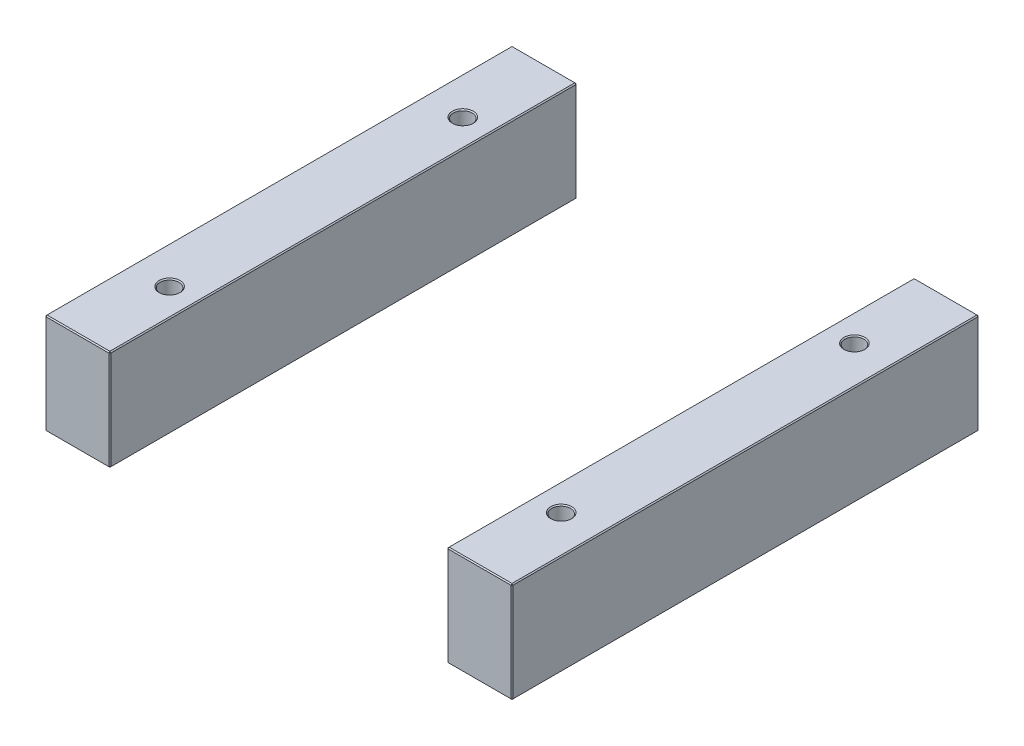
ISO-10303-21;
HEADER;
FILE_DESCRIPTION(('STEP AP214'),'2;1');
FILE_NAME('part.step','',(''),(''),'','','');
FILE_SCHEMA(('AUTOMOTIVE_DESIGN { 1 0 10303 214 1 1 1 1 }'));
ENDSEC;
DATA;
#1=APPLICATION_CONTEXT('core data for automotive mechanical design processes');
#2=APPLICATION_PROTOCOL_DEFINITION('international standard','automotive_design',2000,#1);
#3=PRODUCT_CONTEXT('',#1,'mechanical');
#4=PRODUCT('Part','Part','',(#3));
#5=PRODUCT_RELATED_PRODUCT_CATEGORY('part','',(#4));
#6=PRODUCT_DEFINITION_FORMATION('','',#4);
#7=PRODUCT_DEFINITION_CONTEXT('part definition',#1,'design');
#8=PRODUCT_DEFINITION('design','',#6,#7);
#9=PRODUCT_DEFINITION_SHAPE('','',#8);
#10=(LENGTH_UNIT() NAMED_UNIT(*) SI_UNIT(.MILLI.,.METRE.));
#11=(NAMED_UNIT(*) PLANE_ANGLE_UNIT() SI_UNIT($,.RADIAN.));
#12=(NAMED_UNIT(*) SI_UNIT($,.STERADIAN.) SOLID_ANGLE_UNIT());
#13=UNCERTAINTY_MEASURE_WITH_UNIT(LENGTH_MEASURE(1.E-05),#10,'distance_accuracy_value','');
#14=(GEOMETRIC_REPRESENTATION_CONTEXT(3) GLOBAL_UNCERTAINTY_ASSIGNED_CONTEXT((#13)) GLOBAL_UNIT_ASSIGNED_CONTEXT((#10,
#11,#12)) REPRESENTATION_CONTEXT('',''));
#15=CARTESIAN_POINT('',(0.,0.,0.));
#16=DIRECTION('',(0.,0.,1.));
#17=DIRECTION('',(1.,0.,0.));
#18=AXIS2_PLACEMENT_3D('',#15,#16,#17);
#19=CARTESIAN_POINT('',(-223.,96.,-223.));
#20=DIRECTION('',(0.,0.,1.));
#21=DIRECTION('',(1.,0.,0.));
#22=AXIS2_PLACEMENT_3D('',#19,#20,#21);
#23=PLANE('',#22);
#24=DIRECTION('',(-1.,0.,0.));
#25=VECTOR('',#24,1.);
#26=CARTESIAN_POINT('',(-223.,1.,-223.));
#27=LINE('',#26,#25);
#28=CARTESIAN_POINT('',(-162.,1.,-223.));
#29=VERTEX_POINT('',#28);
#30=CARTESIAN_POINT('',(-222.,1.,-223.));
#31=VERTEX_POINT('',#30);
#32=EDGE_CURVE('P0_E137',#29,#31,#27,.T.);
#33=ORIENTED_EDGE('',*,*,#32,.T.);
#34=DIRECTION('',(0.,1.,0.));
#35=VECTOR('',#34,1.);
#36=CARTESIAN_POINT('',(-222.,96.,-223.));
#37=LINE('',#36,#35);
#38=CARTESIAN_POINT('',(-222.,95.,-223.));
#39=VERTEX_POINT('',#38);
#40=EDGE_CURVE('P0_E235',#31,#39,#37,.T.);
#41=ORIENTED_EDGE('',*,*,#40,.T.);
#42=DIRECTION('',(1.,0.,0.));
#43=VECTOR('',#42,1.);
#44=CARTESIAN_POINT('',(-223.,95.,-223.));
#45=LINE('',#44,#43);
#46=CARTESIAN_POINT('',(-162.,95.,-223.));
#47=VERTEX_POINT('',#46);
#48=EDGE_CURVE('P0_E233',#39,#47,#45,.T.);
#49=ORIENTED_EDGE('',*,*,#48,.T.);
#50=DIRECTION('',(0.,-1.,0.));
#51=VECTOR('',#50,1.);
#52=CARTESIAN_POINT('',(-162.,96.,-223.));
#53=LINE('',#52,#51);
#54=EDGE_CURVE('P0_E230',#47,#29,#53,.T.);
#55=ORIENTED_EDGE('',*,*,#54,.T.);
#56=EDGE_LOOP('',(#33,#41,#49,#55));
#57=FACE_BOUND('',#56,.T.);
#58=ADVANCED_FACE('P0_F16',(#57),#23,.F.);
#59=CARTESIAN_POINT('',(-223.,96.,223.));
#60=DIRECTION('',(1.,0.,0.));
#61=DIRECTION('',(0.,0.,-1.));
#62=AXIS2_PLACEMENT_3D('',#59,#60,#61);
#63=PLANE('',#62);
#64=DIRECTION('',(0.,1.,0.));
#65=VECTOR('',#64,1.);
#66=CARTESIAN_POINT('',(-223.,96.,222.));
#67=LINE('',#66,#65);
#68=CARTESIAN_POINT('',(-223.,1.,222.));
#69=VERTEX_POINT('',#68);
#70=CARTESIAN_POINT('',(-223.,95.,222.));
#71=VERTEX_POINT('',#70);
#72=EDGE_CURVE('P0_E217',#69,#71,#67,.T.);
#73=ORIENTED_EDGE('',*,*,#72,.T.);
#74=DIRECTION('',(0.,0.,-1.));
#75=VECTOR('',#74,1.);
#76=CARTESIAN_POINT('',(-223.,95.,223.));
#77=LINE('',#76,#75);
#78=CARTESIAN_POINT('',(-223.,95.,-222.));
#79=VERTEX_POINT('',#78);
#80=EDGE_CURVE('P0_E228',#71,#79,#77,.T.);
#81=ORIENTED_EDGE('',*,*,#80,.T.);
#82=DIRECTION('',(0.,-1.,0.));
#83=VECTOR('',#82,1.);
#84=CARTESIAN_POINT('',(-223.,96.,-222.));
#85=LINE('',#84,#83);
#86=CARTESIAN_POINT('',(-223.,1.,-222.));
#87=VERTEX_POINT('',#86);
#88=EDGE_CURVE('P0_E225',#79,#87,#85,.T.);
#89=ORIENTED_EDGE('',*,*,#88,.T.);
#90=DIRECTION('',(0.,0.,1.));
#91=VECTOR('',#90,1.);
#92=CARTESIAN_POINT('',(-223.,1.,223.));
#93=LINE('',#92,#91);
#94=EDGE_CURVE('P0_E214',#87,#69,#93,.T.);
#95=ORIENTED_EDGE('',*,*,#94,.T.);
#96=EDGE_LOOP('',(#73,#81,#89,#95));
#97=FACE_BOUND('',#96,.T.);
#98=ADVANCED_FACE('P0_F302',(#97),#63,.F.);
#99=CARTESIAN_POINT('',(-223.,96.,223.));
#100=DIRECTION('',(0.,0.,-1.));
#101=DIRECTION('',(-1.,0.,0.));
#102=AXIS2_PLACEMENT_3D('',#99,#100,#101);
#103=PLANE('',#102);
#104=DIRECTION('',(-1.,0.,0.));
#105=VECTOR('',#104,1.);
#106=CARTESIAN_POINT('',(-223.,95.,223.));
#107=LINE('',#106,#105);
#108=CARTESIAN_POINT('',(-162.,95.,223.));
#109=VERTEX_POINT('',#108);
#110=CARTESIAN_POINT('',(-222.,95.,223.));
#111=VERTEX_POINT('',#110);
#112=EDGE_CURVE('P0_E242',#109,#111,#107,.T.);
#113=ORIENTED_EDGE('',*,*,#112,.T.);
#114=DIRECTION('',(0.,-1.,0.));
#115=VECTOR('',#114,1.);
#116=CARTESIAN_POINT('',(-222.,96.,223.));
#117=LINE('',#116,#115);
#118=CARTESIAN_POINT('',(-222.,1.,223.));
#119=VERTEX_POINT('',#118);
#120=EDGE_CURVE('P0_E244',#111,#119,#117,.T.);
#121=ORIENTED_EDGE('',*,*,#120,.T.);
#122=DIRECTION('',(1.,0.,0.));
#123=VECTOR('',#122,1.);
#124=CARTESIAN_POINT('',(-161.,1.,223.));
#125=LINE('',#124,#123);
#126=CARTESIAN_POINT('',(-162.,1.,223.));
#127=VERTEX_POINT('',#126);
#128=EDGE_CURVE('P0_E240',#119,#127,#125,.T.);
#129=ORIENTED_EDGE('',*,*,#128,.T.);
#130=DIRECTION('',(0.,1.,0.));
#131=VECTOR('',#130,1.);
#132=CARTESIAN_POINT('',(-162.,96.,223.));
#133=LINE('',#132,#131);
#134=EDGE_CURVE('P0_E238',#127,#109,#133,.T.);
#135=ORIENTED_EDGE('',*,*,#134,.T.);
#136=EDGE_LOOP('',(#113,#121,#129,#135));
#137=FACE_BOUND('',#136,.T.);
#138=ADVANCED_FACE('P0_F341',(#137),#103,.F.);
#139=CARTESIAN_POINT('',(-161.,96.,-223.));
#140=DIRECTION('',(-1.,0.,0.));
#141=DIRECTION('',(0.,0.,1.));
#142=AXIS2_PLACEMENT_3D('',#139,#140,#141);
#143=PLANE('',#142);
#144=DIRECTION('',(0.,0.,1.));
#145=VECTOR('',#144,1.);
#146=CARTESIAN_POINT('',(-161.,95.,-223.));
#147=LINE('',#146,#145);
#148=CARTESIAN_POINT('',(-161.,95.,-222.));
#149=VERTEX_POINT('',#148);
#150=CARTESIAN_POINT('',(-161.,95.,222.));
#151=VERTEX_POINT('',#150);
#152=EDGE_CURVE('P0_E31',#149,#151,#147,.T.);
#153=ORIENTED_EDGE('',*,*,#152,.T.);
#154=DIRECTION('',(0.,-1.,0.));
#155=VECTOR('',#154,1.);
#156=CARTESIAN_POINT('',(-161.,96.,222.));
#157=LINE('',#156,#155);
#158=CARTESIAN_POINT('',(-161.,1.,222.));
#159=VERTEX_POINT('',#158);
#160=EDGE_CURVE('P0_E190',#151,#159,#157,.T.);
#161=ORIENTED_EDGE('',*,*,#160,.T.);
#162=DIRECTION('',(0.,0.,-1.));
#163=VECTOR('',#162,1.);
#164=CARTESIAN_POINT('',(-161.,1.,-223.));
#165=LINE('',#164,#163);
#166=CARTESIAN_POINT('',(-161.,1.,-222.));
#167=VERTEX_POINT('',#166);
#168=EDGE_CURVE('P0_E256',#159,#167,#165,.T.);
#169=ORIENTED_EDGE('',*,*,#168,.T.);
#170=DIRECTION('',(0.,1.,0.));
#171=VECTOR('',#170,1.);
#172=CARTESIAN_POINT('',(-161.,96.,-222.));
#173=LINE('',#172,#171);
#174=EDGE_CURVE('P0_E36',#167,#149,#173,.T.);
#175=ORIENTED_EDGE('',*,*,#174,.T.);
#176=EDGE_LOOP('',(#153,#161,#169,#175));
#177=FACE_BOUND('',#176,.T.);
#178=ADVANCED_FACE('P0_F535',(#177),#143,.F.);
#179=CARTESIAN_POINT('',(0.,96.,0.));
#180=DIRECTION('',(0.,-1.,0.));
#181=DIRECTION('',(0.,0.,-1.));
#182=AXIS2_PLACEMENT_3D('',#179,#180,#181);
#183=PLANE('',#182);
#184=CARTESIAN_POINT('',(-187.,96.,140.));
#185=DIRECTION('',(0.,-1.,0.));
#186=DIRECTION('',(0.,0.,-1.));
#187=AXIS2_PLACEMENT_3D('',#184,#185,#186);
#188=CIRCLE('',#187,10.);
#189=CARTESIAN_POINT('',(-187.,96.,130.));
#190=VERTEX_POINT('',#189);
#191=EDGE_CURVE('P0_E24',#190,#190,#188,.T.);
#192=ORIENTED_EDGE('',*,*,#191,.T.);
#193=EDGE_LOOP('',(#192));
#194=FACE_BOUND('',#193,.T.);
#195=CARTESIAN_POINT('',(-187.,96.,-140.));
#196=DIRECTION('',(0.,-1.,0.));
#197=DIRECTION('',(0.,0.,-1.));
#198=AXIS2_PLACEMENT_3D('',#195,#196,#197);
#199=CIRCLE('',#198,10.);
#200=CARTESIAN_POINT('',(-187.,96.,-150.));
#201=VERTEX_POINT('',#200);
#202=EDGE_CURVE('P0_E189',#201,#201,#199,.T.);
#203=ORIENTED_EDGE('',*,*,#202,.T.);
#204=EDGE_LOOP('',(#203));
#205=FACE_BOUND('',#204,.T.);
#206=DIRECTION('',(0.,0.,1.));
#207=VECTOR('',#206,1.);
#208=CARTESIAN_POINT('',(-222.,96.,0.));
#209=LINE('',#208,#207);
#210=CARTESIAN_POINT('',(-222.,96.,-222.));
#211=VERTEX_POINT('',#210);
#212=CARTESIAN_POINT('',(-222.,96.,222.));
#213=VERTEX_POINT('',#212);
#214=EDGE_CURVE('P0_E251',#211,#213,#209,.T.);
#215=ORIENTED_EDGE('',*,*,#214,.T.);
#216=DIRECTION('',(1.,0.,0.));
#217=VECTOR('',#216,1.);
#218=CARTESIAN_POINT('',(0.,96.,222.));
#219=LINE('',#218,#217);
#220=CARTESIAN_POINT('',(-162.,96.,222.));
#221=VERTEX_POINT('',#220);
#222=EDGE_CURVE('P0_E253',#213,#221,#219,.T.);
#223=ORIENTED_EDGE('',*,*,#222,.T.);
#224=DIRECTION('',(0.,0.,-1.));
#225=VECTOR('',#224,1.);
#226=CARTESIAN_POINT('',(-162.,96.,0.));
#227=LINE('',#226,#225);
#228=CARTESIAN_POINT('',(-162.,96.,-222.));
#229=VERTEX_POINT('',#228);
#230=EDGE_CURVE('P0_E247',#221,#229,#227,.T.);
#231=ORIENTED_EDGE('',*,*,#230,.T.);
#232=DIRECTION('',(-1.,0.,0.));
#233=VECTOR('',#232,1.);
#234=CARTESIAN_POINT('',(0.,96.,-222.));
#235=LINE('',#234,#233);
#236=EDGE_CURVE('P0_E249',#229,#211,#235,.T.);
#237=ORIENTED_EDGE('',*,*,#236,.T.);
#238=EDGE_LOOP('',(#215,#223,#231,#237));
#239=FACE_BOUND('',#238,.T.);
#240=ADVANCED_FACE('P0_F195',(#194,#205,#239),#183,.F.);
#241=CARTESIAN_POINT('',(0.,0.,0.));
#242=DIRECTION('',(0.,-1.,0.));
#243=DIRECTION('',(0.,0.,-1.));
#244=AXIS2_PLACEMENT_3D('',#241,#242,#243);
#245=PLANE('',#244);
#246=CARTESIAN_POINT('',(-187.,0.,-140.));
#247=DIRECTION('',(0.,-1.,0.));
#248=DIRECTION('',(0.,0.,-1.));
#249=AXIS2_PLACEMENT_3D('',#246,#247,#248);
#250=CIRCLE('',#249,10.);
#251=CARTESIAN_POINT('',(-187.,0.,-150.));
#252=VERTEX_POINT('',#251);
#253=EDGE_CURVE('P0_E220',#252,#252,#250,.F.);
#254=ORIENTED_EDGE('',*,*,#253,.T.);
#255=EDGE_LOOP('',(#254));
#256=FACE_BOUND('',#255,.T.);
#257=CARTESIAN_POINT('',(-187.,0.,140.));
#258=DIRECTION('',(0.,-1.,0.));
#259=DIRECTION('',(0.,0.,-1.));
#260=AXIS2_PLACEMENT_3D('',#257,#258,#259);
#261=CIRCLE('',#260,10.);
#262=CARTESIAN_POINT('',(-187.,0.,130.));
#263=VERTEX_POINT('',#262);
#264=EDGE_CURVE('P0_E608',#263,#263,#261,.F.);
#265=ORIENTED_EDGE('',*,*,#264,.T.);
#266=EDGE_LOOP('',(#265));
#267=FACE_BOUND('',#266,.T.);
#268=DIRECTION('',(-1.,0.,0.));
#269=VECTOR('',#268,1.);
#270=CARTESIAN_POINT('',(-223.,0.,222.));
#271=LINE('',#270,#269);
#272=CARTESIAN_POINT('',(-162.,0.,222.));
#273=VERTEX_POINT('',#272);
#274=CARTESIAN_POINT('',(-222.,0.,222.));
#275=VERTEX_POINT('',#274);
#276=EDGE_CURVE('P0_E114',#273,#275,#271,.T.);
#277=ORIENTED_EDGE('',*,*,#276,.T.);
#278=DIRECTION('',(0.,0.,-1.));
#279=VECTOR('',#278,1.);
#280=CARTESIAN_POINT('',(-222.,0.,-223.));
#281=LINE('',#280,#279);
#282=CARTESIAN_POINT('',(-222.,0.,-222.));
#283=VERTEX_POINT('',#282);
#284=EDGE_CURVE('P0_E110',#275,#283,#281,.T.);
#285=ORIENTED_EDGE('',*,*,#284,.T.);
#286=DIRECTION('',(1.,0.,0.));
#287=VECTOR('',#286,1.);
#288=CARTESIAN_POINT('',(-161.,0.,-222.));
#289=LINE('',#288,#287);
#290=CARTESIAN_POINT('',(-162.,0.,-222.));
#291=VERTEX_POINT('',#290);
#292=EDGE_CURVE('P0_E104',#283,#291,#289,.T.);
#293=ORIENTED_EDGE('',*,*,#292,.T.);
#294=DIRECTION('',(0.,0.,1.));
#295=VECTOR('',#294,1.);
#296=CARTESIAN_POINT('',(-162.,0.,223.));
#297=LINE('',#296,#295);
#298=EDGE_CURVE('P0_E107',#291,#273,#297,.T.);
#299=ORIENTED_EDGE('',*,*,#298,.T.);
#300=EDGE_LOOP('',(#277,#285,#293,#299));
#301=FACE_BOUND('',#300,.T.);
#302=ADVANCED_FACE('P0_F106',(#256,#267,#301),#245,.T.);
#303=CARTESIAN_POINT('',(-187.,0.,-140.));
#304=DIRECTION('',(0.,1.,0.));
#305=DIRECTION('',(0.,0.,1.));
#306=AXIS2_PLACEMENT_3D('',#303,#304,#305);
#307=CYLINDRICAL_SURFACE('',#306,9.);
#308=CARTESIAN_POINT('',(-187.,95.,-140.));
#309=DIRECTION('',(0.,-1.,0.));
#310=DIRECTION('',(0.,0.,-1.));
#311=AXIS2_PLACEMENT_3D('',#308,#309,#310);
#312=CIRCLE('',#311,9.);
#313=CARTESIAN_POINT('',(-187.,95.,-149.));
#314=VERTEX_POINT('',#313);
#315=EDGE_CURVE('P0_E10',#314,#314,#312,.F.);
#316=ORIENTED_EDGE('',*,*,#315,.T.);
#317=EDGE_LOOP('',(#316));
#318=FACE_BOUND('',#317,.T.);
#319=CARTESIAN_POINT('',(-187.,0.999999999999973,-140.));
#320=DIRECTION('',(0.,-1.,0.));
#321=DIRECTION('',(0.,0.,-1.));
#322=AXIS2_PLACEMENT_3D('',#319,#320,#321);
#323=CIRCLE('',#322,9.);
#324=CARTESIAN_POINT('',(-187.,0.999999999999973,-149.));
#325=VERTEX_POINT('',#324);
#326=EDGE_CURVE('P0_E215',#325,#325,#323,.T.);
#327=ORIENTED_EDGE('',*,*,#326,.T.);
#328=EDGE_LOOP('',(#327));
#329=FACE_BOUND('',#328,.T.);
#330=ADVANCED_FACE('P0_F208',(#318,#329),#307,.F.);
#331=CARTESIAN_POINT('',(-187.,0.,140.));
#332=DIRECTION('',(0.,1.,0.));
#333=DIRECTION('',(0.,0.,1.));
#334=AXIS2_PLACEMENT_3D('',#331,#332,#333);
#335=CYLINDRICAL_SURFACE('',#334,9.);
#336=CARTESIAN_POINT('',(-187.,95.,140.));
#337=DIRECTION('',(0.,-1.,0.));
#338=DIRECTION('',(0.,0.,-1.));
#339=AXIS2_PLACEMENT_3D('',#336,#337,#338);
#340=CIRCLE('',#339,9.);
#341=CARTESIAN_POINT('',(-187.,95.,131.));
#342=VERTEX_POINT('',#341);
#343=EDGE_CURVE('P0_E186',#342,#342,#340,.F.);
#344=ORIENTED_EDGE('',*,*,#343,.T.);
#345=EDGE_LOOP('',(#344));
#346=FACE_BOUND('',#345,.T.);
#347=CARTESIAN_POINT('',(-187.,0.999999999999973,140.));
#348=DIRECTION('',(0.,-1.,0.));
#349=DIRECTION('',(0.,0.,-1.));
#350=AXIS2_PLACEMENT_3D('',#347,#348,#349);
#351=CIRCLE('',#350,9.);
#352=CARTESIAN_POINT('',(-187.,0.999999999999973,131.));
#353=VERTEX_POINT('',#352);
#354=EDGE_CURVE('P0_E212',#353,#353,#351,.T.);
#355=ORIENTED_EDGE('',*,*,#354,.T.);
#356=EDGE_LOOP('',(#355));
#357=FACE_BOUND('',#356,.T.);
#358=ADVANCED_FACE('P0_F204',(#346,#357),#335,.F.);
#359=CARTESIAN_POINT('',(-187.,0.,-140.));
#360=DIRECTION('',(0.,-1.,0.));
#361=DIRECTION('',(0.,0.,-1.));
#362=AXIS2_PLACEMENT_3D('',#359,#360,#361);
#363=CONICAL_SURFACE('',#362,10.,0.78539816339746);
#364=ORIENTED_EDGE('',*,*,#326,.F.);
#365=EDGE_LOOP('',(#364));
#366=FACE_BOUND('',#365,.T.);
#367=ORIENTED_EDGE('',*,*,#253,.F.);
#368=EDGE_LOOP('',(#367));
#369=FACE_BOUND('',#368,.T.);
#370=ADVANCED_FACE('P0_F207',(#366,#369),#363,.F.);
#371=CARTESIAN_POINT('',(-187.,0.,140.));
#372=DIRECTION('',(0.,-1.,0.));
#373=DIRECTION('',(0.,0.,-1.));
#374=AXIS2_PLACEMENT_3D('',#371,#372,#373);
#375=CONICAL_SURFACE('',#374,10.,0.78539816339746);
#376=ORIENTED_EDGE('',*,*,#354,.F.);
#377=EDGE_LOOP('',(#376));
#378=FACE_BOUND('',#377,.T.);
#379=ORIENTED_EDGE('',*,*,#264,.F.);
#380=EDGE_LOOP('',(#379));
#381=FACE_BOUND('',#380,.T.);
#382=ADVANCED_FACE('P0_F347',(#378,#381),#375,.F.);
#383=CARTESIAN_POINT('',(-161.,96.,222.));
#384=DIRECTION('',(-0.707106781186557,0.,-0.707106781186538));
#385=DIRECTION('',(0.,-1.,0.));
#386=AXIS2_PLACEMENT_3D('',#383,#384,#385);
#387=PLANE('',#386);
#388=DIRECTION('',(-0.707106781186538,0.,0.707106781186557));
#389=VECTOR('',#388,1.);
#390=CARTESIAN_POINT('',(-161.5,95.,222.5));
#391=LINE('',#390,#389);
#392=EDGE_CURVE('P0_E125',#109,#151,#391,.F.);
#393=ORIENTED_EDGE('',*,*,#392,.F.);
#394=ORIENTED_EDGE('',*,*,#134,.F.);
#395=DIRECTION('',(0.707106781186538,0.,-0.707106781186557));
#396=VECTOR('',#395,1.);
#397=CARTESIAN_POINT('',(-162.,1.,223.));
#398=LINE('',#397,#396);
#399=EDGE_CURVE('P0_E181',#159,#127,#398,.F.);
#400=ORIENTED_EDGE('',*,*,#399,.F.);
#401=ORIENTED_EDGE('',*,*,#160,.F.);
#402=EDGE_LOOP('',(#393,#394,#400,#401));
#403=FACE_BOUND('',#402,.T.);
#404=ADVANCED_FACE('P0_F351',(#403),#387,.F.);
#405=CARTESIAN_POINT('',(-162.,96.,222.));
#406=DIRECTION('',(0.577350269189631,0.577350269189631,0.577350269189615));
#407=DIRECTION('',(-0.707106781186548,0.707106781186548,0.));
#408=AXIS2_PLACEMENT_3D('',#405,#406,#407);
#409=PLANE('',#408);
#410=DIRECTION('',(0.,0.707106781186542,-0.707106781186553));
#411=VECTOR('',#410,1.);
#412=CARTESIAN_POINT('',(-162.,96.,222.));
#413=LINE('',#412,#411);
#414=EDGE_CURVE('P0_E175',#109,#221,#413,.T.);
#415=ORIENTED_EDGE('',*,*,#414,.F.);
#416=ORIENTED_EDGE('',*,*,#392,.T.);
#417=DIRECTION('',(0.707106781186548,-0.707106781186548,0.));
#418=VECTOR('',#417,1.);
#419=CARTESIAN_POINT('',(-162.,96.,222.));
#420=LINE('',#419,#418);
#421=EDGE_CURVE('P0_E178',#221,#151,#420,.T.);
#422=ORIENTED_EDGE('',*,*,#421,.F.);
#423=EDGE_LOOP('',(#415,#416,#422));
#424=FACE_BOUND('',#423,.T.);
#425=ADVANCED_FACE('P0_F487',(#424),#409,.T.);
#426=CARTESIAN_POINT('',(-162.,1.,223.));
#427=DIRECTION('',(0.577350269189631,-0.577350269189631,0.577350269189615));
#428=DIRECTION('',(0.707106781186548,0.707106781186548,0.));
#429=AXIS2_PLACEMENT_3D('',#426,#427,#428);
#430=PLANE('',#429);
#431=DIRECTION('',(0.707106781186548,0.707106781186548,0.));
#432=VECTOR('',#431,1.);
#433=CARTESIAN_POINT('',(-161.5,0.5,222.));
#434=LINE('',#433,#432);
#435=EDGE_CURVE('P0_E123',#159,#273,#434,.F.);
#436=ORIENTED_EDGE('',*,*,#435,.F.);
#437=ORIENTED_EDGE('',*,*,#399,.T.);
#438=DIRECTION('',(0.,-0.707106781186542,-0.707106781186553));
#439=VECTOR('',#438,1.);
#440=CARTESIAN_POINT('',(-162.,1.,223.));
#441=LINE('',#440,#439);
#442=EDGE_CURVE('P0_E172',#273,#127,#441,.F.);
#443=ORIENTED_EDGE('',*,*,#442,.F.);
#444=EDGE_LOOP('',(#436,#437,#443));
#445=FACE_BOUND('',#444,.T.);
#446=ADVANCED_FACE('P0_F478',(#445),#430,.T.);
#447=CARTESIAN_POINT('',(-162.,96.,0.));
#448=DIRECTION('',(-0.707106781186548,-0.707106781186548,0.));
#449=DIRECTION('',(0.,0.,-1.));
#450=AXIS2_PLACEMENT_3D('',#447,#448,#449);
#451=PLANE('',#450);
#452=ORIENTED_EDGE('',*,*,#421,.T.);
#453=ORIENTED_EDGE('',*,*,#152,.F.);
#454=DIRECTION('',(-0.707106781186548,0.707106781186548,0.));
#455=VECTOR('',#454,1.);
#456=CARTESIAN_POINT('',(-161.5,95.5,-222.));
#457=LINE('',#456,#455);
#458=EDGE_CURVE('P0_E165',#229,#149,#457,.F.);
#459=ORIENTED_EDGE('',*,*,#458,.F.);
#460=ORIENTED_EDGE('',*,*,#230,.F.);
#461=EDGE_LOOP('',(#452,#453,#459,#460));
#462=FACE_BOUND('',#461,.T.);
#463=ADVANCED_FACE('P0_F318',(#462),#451,.F.);
#464=CARTESIAN_POINT('',(0.,96.,222.));
#465=DIRECTION('',(0.,-0.707106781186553,-0.707106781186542));
#466=DIRECTION('',(1.,0.,0.));
#467=AXIS2_PLACEMENT_3D('',#464,#465,#466);
#468=PLANE('',#467);
#469=ORIENTED_EDGE('',*,*,#414,.T.);
#470=ORIENTED_EDGE('',*,*,#222,.F.);
#471=DIRECTION('',(0.,-0.707106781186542,0.707106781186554));
#472=VECTOR('',#471,1.);
#473=CARTESIAN_POINT('',(-222.,95.5,222.5));
#474=LINE('',#473,#472);
#475=EDGE_CURVE('P0_E162',#111,#213,#474,.F.);
#476=ORIENTED_EDGE('',*,*,#475,.F.);
#477=ORIENTED_EDGE('',*,*,#112,.F.);
#478=EDGE_LOOP('',(#469,#470,#476,#477));
#479=FACE_BOUND('',#478,.T.);
#480=ADVANCED_FACE('P0_F313',(#479),#468,.F.);
#481=CARTESIAN_POINT('',(-222.,96.,223.));
#482=DIRECTION('',(0.707106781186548,0.,-0.707106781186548));
#483=DIRECTION('',(0.,-1.,0.));
#484=AXIS2_PLACEMENT_3D('',#481,#482,#483);
#485=PLANE('',#484);
#486=DIRECTION('',(0.707106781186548,0.,0.707106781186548));
#487=VECTOR('',#486,1.);
#488=CARTESIAN_POINT('',(-222.,1.,223.));
#489=LINE('',#488,#487);
#490=EDGE_CURVE('P0_E156',#119,#69,#489,.F.);
#491=ORIENTED_EDGE('',*,*,#490,.F.);
#492=ORIENTED_EDGE('',*,*,#120,.F.);
#493=DIRECTION('',(-0.707106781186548,0.,-0.707106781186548));
#494=VECTOR('',#493,1.);
#495=CARTESIAN_POINT('',(-223.,95.,222.));
#496=LINE('',#495,#494);
#497=EDGE_CURVE('P0_E159',#71,#111,#496,.F.);
#498=ORIENTED_EDGE('',*,*,#497,.F.);
#499=ORIENTED_EDGE('',*,*,#72,.F.);
#500=EDGE_LOOP('',(#491,#492,#498,#499));
#501=FACE_BOUND('',#500,.T.);
#502=ADVANCED_FACE('P0_F307',(#501),#485,.F.);
#503=CARTESIAN_POINT('',(-223.,1.,223.));
#504=DIRECTION('',(0.,-0.707106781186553,0.707106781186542));
#505=DIRECTION('',(-1.,0.,0.));
#506=AXIS2_PLACEMENT_3D('',#503,#504,#505);
#507=PLANE('',#506);
#508=ORIENTED_EDGE('',*,*,#442,.T.);
#509=ORIENTED_EDGE('',*,*,#128,.F.);
#510=DIRECTION('',(0.,0.707106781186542,0.707106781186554));
#511=VECTOR('',#510,1.);
#512=CARTESIAN_POINT('',(-222.,1.,223.));
#513=LINE('',#512,#511);
#514=EDGE_CURVE('P0_E134',#275,#119,#513,.T.);
#515=ORIENTED_EDGE('',*,*,#514,.F.);
#516=ORIENTED_EDGE('',*,*,#276,.F.);
#517=EDGE_LOOP('',(#508,#509,#515,#516));
#518=FACE_BOUND('',#517,.T.);
#519=ADVANCED_FACE('P0_F333',(#518),#507,.T.);
#520=CARTESIAN_POINT('',(-161.,1.,-223.));
#521=DIRECTION('',(0.707106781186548,-0.707106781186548,0.));
#522=DIRECTION('',(0.,0.,1.));
#523=AXIS2_PLACEMENT_3D('',#520,#521,#522);
#524=PLANE('',#523);
#525=ORIENTED_EDGE('',*,*,#435,.T.);
#526=ORIENTED_EDGE('',*,*,#298,.F.);
#527=DIRECTION('',(-0.707106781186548,-0.707106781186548,0.));
#528=VECTOR('',#527,1.);
#529=CARTESIAN_POINT('',(-162.,0.,-222.));
#530=LINE('',#529,#528);
#531=EDGE_CURVE('P0_E120',#167,#291,#530,.T.);
#532=ORIENTED_EDGE('',*,*,#531,.F.);
#533=ORIENTED_EDGE('',*,*,#168,.F.);
#534=EDGE_LOOP('',(#525,#526,#532,#533));
#535=FACE_BOUND('',#534,.T.);
#536=ADVANCED_FACE('P0_F119',(#535),#524,.T.);
#537=CARTESIAN_POINT('',(-162.,96.,-223.));
#538=DIRECTION('',(-0.707106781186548,0.,0.707106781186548));
#539=DIRECTION('',(0.,-1.,0.));
#540=AXIS2_PLACEMENT_3D('',#537,#538,#539);
#541=PLANE('',#540);
#542=DIRECTION('',(0.707106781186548,0.,0.707106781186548));
#543=VECTOR('',#542,1.);
#544=CARTESIAN_POINT('',(-162.,95.,-223.));
#545=LINE('',#544,#543);
#546=EDGE_CURVE('P0_E168',#149,#47,#545,.F.);
#547=ORIENTED_EDGE('',*,*,#546,.F.);
#548=ORIENTED_EDGE('',*,*,#174,.F.);
#549=DIRECTION('',(-0.707106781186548,0.,-0.707106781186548));
#550=VECTOR('',#549,1.);
#551=CARTESIAN_POINT('',(-161.5,1.,-222.5));
#552=LINE('',#551,#550);
#553=EDGE_CURVE('P0_E133',#29,#167,#552,.F.);
#554=ORIENTED_EDGE('',*,*,#553,.F.);
#555=ORIENTED_EDGE('',*,*,#54,.F.);
#556=EDGE_LOOP('',(#547,#548,#554,#555));
#557=FACE_BOUND('',#556,.T.);
#558=ADVANCED_FACE('P0_F323',(#557),#541,.F.);
#559=CARTESIAN_POINT('',(-162.,95.,-223.));
#560=DIRECTION('',(0.577350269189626,0.577350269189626,-0.577350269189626));
#561=DIRECTION('',(-0.707106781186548,0.,-0.707106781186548));
#562=AXIS2_PLACEMENT_3D('',#559,#560,#561);
#563=PLANE('',#562);
#564=ORIENTED_EDGE('',*,*,#458,.T.);
#565=ORIENTED_EDGE('',*,*,#546,.T.);
#566=DIRECTION('',(0.,-0.707106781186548,-0.707106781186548));
#567=VECTOR('',#566,1.);
#568=CARTESIAN_POINT('',(-162.,95.,-223.));
#569=LINE('',#568,#567);
#570=EDGE_CURVE('P0_E151',#229,#47,#569,.T.);
#571=ORIENTED_EDGE('',*,*,#570,.F.);
#572=EDGE_LOOP('',(#564,#565,#571));
#573=FACE_BOUND('',#572,.T.);
#574=ADVANCED_FACE('P0_F321',(#573),#563,.T.);
#575=CARTESIAN_POINT('',(-223.,95.,222.));
#576=DIRECTION('',(-0.57735026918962,0.577350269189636,0.57735026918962));
#577=DIRECTION('',(0.,-0.707106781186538,0.707106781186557));
#578=AXIS2_PLACEMENT_3D('',#575,#576,#577);
#579=PLANE('',#578);
#580=ORIENTED_EDGE('',*,*,#497,.T.);
#581=ORIENTED_EDGE('',*,*,#475,.T.);
#582=DIRECTION('',(0.707106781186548,0.707106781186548,0.));
#583=VECTOR('',#582,1.);
#584=CARTESIAN_POINT('',(-223.,95.,222.));
#585=LINE('',#584,#583);
#586=EDGE_CURVE('P0_E142',#71,#213,#585,.T.);
#587=ORIENTED_EDGE('',*,*,#586,.F.);
#588=EDGE_LOOP('',(#580,#581,#587));
#589=FACE_BOUND('',#588,.T.);
#590=ADVANCED_FACE('P0_F310',(#589),#579,.T.);
#591=CARTESIAN_POINT('',(-222.,1.,223.));
#592=DIRECTION('',(-0.57735026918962,-0.577350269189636,0.57735026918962));
#593=DIRECTION('',(0.,-0.707106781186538,-0.707106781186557));
#594=AXIS2_PLACEMENT_3D('',#591,#592,#593);
#595=PLANE('',#594);
#596=ORIENTED_EDGE('',*,*,#514,.T.);
#597=ORIENTED_EDGE('',*,*,#490,.T.);
#598=DIRECTION('',(0.707106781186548,-0.707106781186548,0.));
#599=VECTOR('',#598,1.);
#600=CARTESIAN_POINT('',(-222.5,0.500000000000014,222.));
#601=LINE('',#600,#599);
#602=EDGE_CURVE('P0_E138',#275,#69,#601,.F.);
#603=ORIENTED_EDGE('',*,*,#602,.F.);
#604=EDGE_LOOP('',(#596,#597,#603));
#605=FACE_BOUND('',#604,.T.);
#606=ADVANCED_FACE('P0_F368',(#605),#595,.T.);
#607=CARTESIAN_POINT('',(-162.,0.,-222.));
#608=DIRECTION('',(0.577350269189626,-0.577350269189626,-0.577350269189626));
#609=DIRECTION('',(-0.707106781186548,0.,-0.707106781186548));
#610=AXIS2_PLACEMENT_3D('',#607,#608,#609);
#611=PLANE('',#610);
#612=ORIENTED_EDGE('',*,*,#553,.T.);
#613=ORIENTED_EDGE('',*,*,#531,.T.);
#614=DIRECTION('',(0.,0.707106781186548,-0.707106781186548));
#615=VECTOR('',#614,1.);
#616=CARTESIAN_POINT('',(-162.,0.,-222.));
#617=LINE('',#616,#615);
#618=EDGE_CURVE('P0_E130',#29,#291,#617,.F.);
#619=ORIENTED_EDGE('',*,*,#618,.F.);
#620=EDGE_LOOP('',(#612,#613,#619));
#621=FACE_BOUND('',#620,.T.);
#622=ADVANCED_FACE('P0_F129',(#621),#611,.T.);
#623=CARTESIAN_POINT('',(0.,96.,-222.));
#624=DIRECTION('',(0.,-0.707106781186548,0.707106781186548));
#625=DIRECTION('',(-1.,0.,0.));
#626=AXIS2_PLACEMENT_3D('',#623,#624,#625);
#627=PLANE('',#626);
#628=ORIENTED_EDGE('',*,*,#570,.T.);
#629=ORIENTED_EDGE('',*,*,#48,.F.);
#630=DIRECTION('',(0.,0.707106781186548,0.707106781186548));
#631=VECTOR('',#630,1.);
#632=CARTESIAN_POINT('',(-222.,95.,-223.));
#633=LINE('',#632,#631);
#634=EDGE_CURVE('P0_E139',#211,#39,#633,.F.);
#635=ORIENTED_EDGE('',*,*,#634,.F.);
#636=ORIENTED_EDGE('',*,*,#236,.F.);
#637=EDGE_LOOP('',(#628,#629,#635,#636));
#638=FACE_BOUND('',#637,.T.);
#639=ADVANCED_FACE('P0_F286',(#638),#627,.F.);
#640=CARTESIAN_POINT('',(-222.,96.,0.));
#641=DIRECTION('',(0.707106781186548,-0.707106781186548,0.));
#642=DIRECTION('',(0.,0.,1.));
#643=AXIS2_PLACEMENT_3D('',#640,#641,#642);
#644=PLANE('',#643);
#645=ORIENTED_EDGE('',*,*,#586,.T.);
#646=ORIENTED_EDGE('',*,*,#214,.F.);
#647=DIRECTION('',(-0.707106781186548,-0.707106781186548,0.));
#648=VECTOR('',#647,1.);
#649=CARTESIAN_POINT('',(-222.5,95.5,-222.));
#650=LINE('',#649,#648);
#651=EDGE_CURVE('P0_E145',#79,#211,#650,.F.);
#652=ORIENTED_EDGE('',*,*,#651,.F.);
#653=ORIENTED_EDGE('',*,*,#80,.F.);
#654=EDGE_LOOP('',(#645,#646,#652,#653));
#655=FACE_BOUND('',#654,.T.);
#656=ADVANCED_FACE('P0_F280',(#655),#644,.F.);
#657=CARTESIAN_POINT('',(-223.,1.,223.));
#658=DIRECTION('',(-0.707106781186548,-0.707106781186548,0.));
#659=DIRECTION('',(0.,0.,-1.));
#660=AXIS2_PLACEMENT_3D('',#657,#658,#659);
#661=PLANE('',#660);
#662=ORIENTED_EDGE('',*,*,#602,.T.);
#663=ORIENTED_EDGE('',*,*,#94,.F.);
#664=DIRECTION('',(-0.707106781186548,0.707106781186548,0.));
#665=VECTOR('',#664,1.);
#666=CARTESIAN_POINT('',(-223.,1.,-222.));
#667=LINE('',#666,#665);
#668=EDGE_CURVE('P0_E267',#283,#87,#667,.T.);
#669=ORIENTED_EDGE('',*,*,#668,.F.);
#670=ORIENTED_EDGE('',*,*,#284,.F.);
#671=EDGE_LOOP('',(#662,#663,#669,#670));
#672=FACE_BOUND('',#671,.T.);
#673=ADVANCED_FACE('P0_F298',(#672),#661,.T.);
#674=CARTESIAN_POINT('',(-223.,1.,-223.));
#675=DIRECTION('',(0.,-0.707106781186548,-0.707106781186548));
#676=DIRECTION('',(1.,0.,0.));
#677=AXIS2_PLACEMENT_3D('',#674,#675,#676);
#678=PLANE('',#677);
#679=ORIENTED_EDGE('',*,*,#618,.T.);
#680=ORIENTED_EDGE('',*,*,#292,.F.);
#681=DIRECTION('',(0.,-0.707106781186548,0.707106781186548));
#682=VECTOR('',#681,1.);
#683=CARTESIAN_POINT('',(-222.,0.5,-222.5));
#684=LINE('',#683,#682);
#685=EDGE_CURVE('P0_E265',#31,#283,#684,.T.);
#686=ORIENTED_EDGE('',*,*,#685,.F.);
#687=ORIENTED_EDGE('',*,*,#32,.F.);
#688=EDGE_LOOP('',(#679,#680,#686,#687));
#689=FACE_BOUND('',#688,.T.);
#690=ADVANCED_FACE('P0_F136',(#689),#678,.T.);
#691=CARTESIAN_POINT('',(-222.,95.,-223.));
#692=DIRECTION('',(-0.577350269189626,0.577350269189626,-0.577350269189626));
#693=DIRECTION('',(-0.707106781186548,0.,0.707106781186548));
#694=AXIS2_PLACEMENT_3D('',#691,#692,#693);
#695=PLANE('',#694);
#696=ORIENTED_EDGE('',*,*,#651,.T.);
#697=ORIENTED_EDGE('',*,*,#634,.T.);
#698=DIRECTION('',(0.707106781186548,0.,-0.707106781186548));
#699=VECTOR('',#698,1.);
#700=CARTESIAN_POINT('',(-222.,95.,-223.));
#701=LINE('',#700,#699);
#702=EDGE_CURVE('P0_E263',#79,#39,#701,.T.);
#703=ORIENTED_EDGE('',*,*,#702,.F.);
#704=EDGE_LOOP('',(#696,#697,#703));
#705=FACE_BOUND('',#704,.T.);
#706=ADVANCED_FACE('P0_F273',(#705),#695,.T.);
#707=CARTESIAN_POINT('',(-223.,1.,-222.));
#708=DIRECTION('',(-0.577350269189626,-0.577350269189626,-0.577350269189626));
#709=DIRECTION('',(-0.707106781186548,0.,0.707106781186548));
#710=AXIS2_PLACEMENT_3D('',#707,#708,#709);
#711=PLANE('',#710);
#712=ORIENTED_EDGE('',*,*,#685,.T.);
#713=ORIENTED_EDGE('',*,*,#668,.T.);
#714=DIRECTION('',(-0.707106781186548,0.,0.707106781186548));
#715=VECTOR('',#714,1.);
#716=CARTESIAN_POINT('',(-223.,1.,-222.));
#717=LINE('',#716,#715);
#718=EDGE_CURVE('P0_E261',#31,#87,#717,.T.);
#719=ORIENTED_EDGE('',*,*,#718,.F.);
#720=EDGE_LOOP('',(#712,#713,#719));
#721=FACE_BOUND('',#720,.T.);
#722=ADVANCED_FACE('P0_F294',(#721),#711,.T.);
#723=CARTESIAN_POINT('',(-223.,96.,-222.));
#724=DIRECTION('',(0.707106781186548,0.,0.707106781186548));
#725=DIRECTION('',(0.,-1.,0.));
#726=AXIS2_PLACEMENT_3D('',#723,#724,#725);
#727=PLANE('',#726);
#728=ORIENTED_EDGE('',*,*,#702,.T.);
#729=ORIENTED_EDGE('',*,*,#40,.F.);
#730=ORIENTED_EDGE('',*,*,#718,.T.);
#731=ORIENTED_EDGE('',*,*,#88,.F.);
#732=EDGE_LOOP('',(#728,#729,#730,#731));
#733=FACE_BOUND('',#732,.T.);
#734=ADVANCED_FACE('P0_F201',(#733),#727,.F.);
#735=CARTESIAN_POINT('',(-187.,95.,140.));
#736=DIRECTION('',(0.,1.,0.));
#737=DIRECTION('',(0.,0.,1.));
#738=AXIS2_PLACEMENT_3D('',#735,#736,#737);
#739=CONICAL_SURFACE('',#738,9.,0.78539816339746);
#740=ORIENTED_EDGE('',*,*,#191,.F.);
#741=EDGE_LOOP('',(#740));
#742=FACE_BOUND('',#741,.T.);
#743=ORIENTED_EDGE('',*,*,#343,.F.);
#744=EDGE_LOOP('',(#743));
#745=FACE_BOUND('',#744,.T.);
#746=ADVANCED_FACE('P0_F198',(#742,#745),#739,.F.);
#747=CARTESIAN_POINT('',(-187.,95.,-140.));
#748=DIRECTION('',(0.,1.,0.));
#749=DIRECTION('',(0.,0.,1.));
#750=AXIS2_PLACEMENT_3D('',#747,#748,#749);
#751=CONICAL_SURFACE('',#750,9.,0.78539816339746);
#752=ORIENTED_EDGE('',*,*,#202,.F.);
#753=EDGE_LOOP('',(#752));
#754=FACE_BOUND('',#753,.T.);
#755=ORIENTED_EDGE('',*,*,#315,.F.);
#756=EDGE_LOOP('',(#755));
#757=FACE_BOUND('',#756,.T.);
#758=ADVANCED_FACE('P0_F18',(#754,#757),#751,.F.);
#759=CLOSED_SHELL('',(#58,#98,#138,#178,#240,#302,#330,#358,#370,#382,#404,#425,#446,#463,#480,
#502,#519,#536,#558,#574,#590,#606,#622,#639,#656,#673,#690,#706,#722,#734,#746,#758));
#760=MANIFOLD_SOLID_BREP('P0_B1',#759);
#761=CARTESIAN_POINT('',(223.,96.,223.));
#762=DIRECTION('',(0.,0.,-1.));
#763=DIRECTION('',(-1.,0.,0.));
#764=AXIS2_PLACEMENT_3D('',#761,#762,#763);
#765=PLANE('',#764);
#766=DIRECTION('',(0.,-1.,0.));
#767=VECTOR('',#766,1.);
#768=CARTESIAN_POINT('',(162.,96.,223.));
#769=LINE('',#768,#767);
#770=CARTESIAN_POINT('',(162.,95.,223.));
#771=VERTEX_POINT('',#770);
#772=CARTESIAN_POINT('',(162.,1.00000000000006,223.));
#773=VERTEX_POINT('',#772);
#774=EDGE_CURVE('P1_E174',#771,#773,#769,.T.);
#775=ORIENTED_EDGE('',*,*,#774,.T.);
#776=DIRECTION('',(1.,0.,0.));
#777=VECTOR('',#776,1.);
#778=CARTESIAN_POINT('',(223.,1.00000000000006,223.));
#779=LINE('',#778,#777);
#780=CARTESIAN_POINT('',(222.,1.00000000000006,223.));
#781=VERTEX_POINT('',#780);
#782=EDGE_CURVE('P1_E176',#773,#781,#779,.T.);
#783=ORIENTED_EDGE('',*,*,#782,.T.);
#784=DIRECTION('',(0.,1.,0.));
#785=VECTOR('',#784,1.);
#786=CARTESIAN_POINT('',(222.,96.,223.));
#787=LINE('',#786,#785);
#788=CARTESIAN_POINT('',(222.,95.,223.));
#789=VERTEX_POINT('',#788);
#790=EDGE_CURVE('P1_E172',#781,#789,#787,.T.);
#791=ORIENTED_EDGE('',*,*,#790,.T.);
#792=DIRECTION('',(-1.,0.,0.));
#793=VECTOR('',#792,1.);
#794=CARTESIAN_POINT('',(161.,95.,223.));
#795=LINE('',#794,#793);
#796=EDGE_CURVE('P1_E170',#789,#771,#795,.T.);
#797=ORIENTED_EDGE('',*,*,#796,.T.);
#798=EDGE_LOOP('',(#775,#783,#791,#797));
#799=FACE_BOUND('',#798,.T.);
#800=ADVANCED_FACE('P1_F17',(#799),#765,.F.);
#801=CARTESIAN_POINT('',(223.,96.,223.));
#802=DIRECTION('',(-1.,0.,0.));
#803=DIRECTION('',(0.,0.,1.));
#804=AXIS2_PLACEMENT_3D('',#801,#802,#803);
#805=PLANE('',#804);
#806=DIRECTION('',(0.,0.,1.));
#807=VECTOR('',#806,1.);
#808=CARTESIAN_POINT('',(223.,95.,223.));
#809=LINE('',#808,#807);
#810=CARTESIAN_POINT('',(223.,95.,-222.));
#811=VERTEX_POINT('',#810);
#812=CARTESIAN_POINT('',(223.,95.,222.));
#813=VERTEX_POINT('',#812);
#814=EDGE_CURVE('P1_E188',#811,#813,#809,.T.);
#815=ORIENTED_EDGE('',*,*,#814,.T.);
#816=DIRECTION('',(0.,-1.,0.));
#817=VECTOR('',#816,1.);
#818=CARTESIAN_POINT('',(223.,96.,222.));
#819=LINE('',#818,#817);
#820=CARTESIAN_POINT('',(223.,1.,222.));
#821=VERTEX_POINT('',#820);
#822=EDGE_CURVE('P1_E194',#813,#821,#819,.T.);
#823=ORIENTED_EDGE('',*,*,#822,.T.);
#824=DIRECTION('',(0.,0.,-1.));
#825=VECTOR('',#824,1.);
#826=CARTESIAN_POINT('',(223.,1.,223.));
#827=LINE('',#826,#825);
#828=CARTESIAN_POINT('',(223.,1.,-222.));
#829=VERTEX_POINT('',#828);
#830=EDGE_CURVE('P1_E192',#821,#829,#827,.T.);
#831=ORIENTED_EDGE('',*,*,#830,.T.);
#832=DIRECTION('',(0.,1.,0.));
#833=VECTOR('',#832,1.);
#834=CARTESIAN_POINT('',(223.,96.,-222.));
#835=LINE('',#834,#833);
#836=EDGE_CURVE('P1_E190',#829,#811,#835,.T.);
#837=ORIENTED_EDGE('',*,*,#836,.T.);
#838=EDGE_LOOP('',(#815,#823,#831,#837));
#839=FACE_BOUND('',#838,.T.);
#840=ADVANCED_FACE('P1_F276',(#839),#805,.F.);
#841=CARTESIAN_POINT('',(223.,96.,-223.));
#842=DIRECTION('',(0.,0.,1.));
#843=DIRECTION('',(1.,0.,0.));
#844=AXIS2_PLACEMENT_3D('',#841,#842,#843);
#845=PLANE('',#844);
#846=DIRECTION('',(0.,-1.,0.));
#847=VECTOR('',#846,1.);
#848=CARTESIAN_POINT('',(222.,96.,-223.));
#849=LINE('',#848,#847);
#850=CARTESIAN_POINT('',(222.,95.,-223.));
#851=VERTEX_POINT('',#850);
#852=CARTESIAN_POINT('',(222.,1.,-223.));
#853=VERTEX_POINT('',#852);
#854=EDGE_CURVE('P1_E165',#851,#853,#849,.T.);
#855=ORIENTED_EDGE('',*,*,#854,.T.);
#856=DIRECTION('',(-1.,0.,0.));
#857=VECTOR('',#856,1.);
#858=CARTESIAN_POINT('',(223.,1.,-223.));
#859=LINE('',#858,#857);
#860=CARTESIAN_POINT('',(162.,1.,-223.));
#861=VERTEX_POINT('',#860);
#862=EDGE_CURVE('P1_E113',#853,#861,#859,.T.);
#863=ORIENTED_EDGE('',*,*,#862,.T.);
#864=DIRECTION('',(0.,1.,0.));
#865=VECTOR('',#864,1.);
#866=CARTESIAN_POINT('',(162.,96.,-223.));
#867=LINE('',#866,#865);
#868=CARTESIAN_POINT('',(162.,95.,-223.));
#869=VERTEX_POINT('',#868);
#870=EDGE_CURVE('P1_E167',#861,#869,#867,.T.);
#871=ORIENTED_EDGE('',*,*,#870,.T.);
#872=DIRECTION('',(1.,0.,0.));
#873=VECTOR('',#872,1.);
#874=CARTESIAN_POINT('',(223.,95.,-223.));
#875=LINE('',#874,#873);
#876=EDGE_CURVE('P1_E163',#869,#851,#875,.T.);
#877=ORIENTED_EDGE('',*,*,#876,.T.);
#878=EDGE_LOOP('',(#855,#863,#871,#877));
#879=FACE_BOUND('',#878,.T.);
#880=ADVANCED_FACE('P1_F333',(#879),#845,.F.);
#881=CARTESIAN_POINT('',(161.,96.,-223.));
#882=DIRECTION('',(1.,0.,0.));
#883=DIRECTION('',(0.,0.,-1.));
#884=AXIS2_PLACEMENT_3D('',#881,#882,#883);
#885=PLANE('',#884);
#886=DIRECTION('',(0.,0.,-1.));
#887=VECTOR('',#886,1.);
#888=CARTESIAN_POINT('',(161.,95.,-223.));
#889=LINE('',#888,#887);
#890=CARTESIAN_POINT('',(161.,95.,222.));
#891=VERTEX_POINT('',#890);
#892=CARTESIAN_POINT('',(161.,95.,-222.));
#893=VERTEX_POINT('',#892);
#894=EDGE_CURVE('P1_E179',#891,#893,#889,.T.);
#895=ORIENTED_EDGE('',*,*,#894,.T.);
#896=DIRECTION('',(0.,-1.,0.));
#897=VECTOR('',#896,1.);
#898=CARTESIAN_POINT('',(161.,96.,-222.));
#899=LINE('',#898,#897);
#900=CARTESIAN_POINT('',(161.,1.,-222.));
#901=VERTEX_POINT('',#900);
#902=EDGE_CURVE('P1_E185',#893,#901,#899,.T.);
#903=ORIENTED_EDGE('',*,*,#902,.T.);
#904=DIRECTION('',(0.,0.,1.));
#905=VECTOR('',#904,1.);
#906=CARTESIAN_POINT('',(161.,1.,-223.));
#907=LINE('',#906,#905);
#908=CARTESIAN_POINT('',(161.,1.,222.));
#909=VERTEX_POINT('',#908);
#910=EDGE_CURVE('P1_E183',#901,#909,#907,.T.);
#911=ORIENTED_EDGE('',*,*,#910,.T.);
#912=DIRECTION('',(0.,1.,0.));
#913=VECTOR('',#912,1.);
#914=CARTESIAN_POINT('',(161.,96.,222.));
#915=LINE('',#914,#913);
#916=EDGE_CURVE('P1_E181',#909,#891,#915,.T.);
#917=ORIENTED_EDGE('',*,*,#916,.T.);
#918=EDGE_LOOP('',(#895,#903,#911,#917));
#919=FACE_BOUND('',#918,.T.);
#920=ADVANCED_FACE('P1_F544',(#919),#885,.F.);
#921=CARTESIAN_POINT('',(0.,96.,0.));
#922=DIRECTION('',(0.,1.,0.));
#923=DIRECTION('',(0.,0.,1.));
#924=AXIS2_PLACEMENT_3D('',#921,#922,#923);
#925=PLANE('',#924);
#926=DIRECTION('',(-1.,0.,0.));
#927=VECTOR('',#926,1.);
#928=CARTESIAN_POINT('',(161.,96.,-222.));
#929=LINE('',#928,#927);
#930=CARTESIAN_POINT('',(222.,96.,-222.));
#931=VERTEX_POINT('',#930);
#932=CARTESIAN_POINT('',(162.,96.,-222.));
#933=VERTEX_POINT('',#932);
#934=EDGE_CURVE('P1_E26',#931,#933,#929,.T.);
#935=ORIENTED_EDGE('',*,*,#934,.T.);
#936=DIRECTION('',(0.,0.,1.));
#937=VECTOR('',#936,1.);
#938=CARTESIAN_POINT('',(162.,96.,223.));
#939=LINE('',#938,#937);
#940=CARTESIAN_POINT('',(162.,96.,222.));
#941=VERTEX_POINT('',#940);
#942=EDGE_CURVE('P1_E11',#933,#941,#939,.T.);
#943=ORIENTED_EDGE('',*,*,#942,.T.);
#944=DIRECTION('',(1.,0.,0.));
#945=VECTOR('',#944,1.);
#946=CARTESIAN_POINT('',(223.,96.,222.));
#947=LINE('',#946,#945);
#948=CARTESIAN_POINT('',(222.,96.,222.));
#949=VERTEX_POINT('',#948);
#950=EDGE_CURVE('P1_E203',#941,#949,#947,.T.);
#951=ORIENTED_EDGE('',*,*,#950,.T.);
#952=DIRECTION('',(0.,0.,-1.));
#953=VECTOR('',#952,1.);
#954=CARTESIAN_POINT('',(222.,96.,-223.));
#955=LINE('',#954,#953);
#956=EDGE_CURVE('P1_E37',#949,#931,#955,.T.);
#957=ORIENTED_EDGE('',*,*,#956,.T.);
#958=EDGE_LOOP('',(#935,#943,#951,#957));
#959=FACE_BOUND('',#958,.T.);
#960=CARTESIAN_POINT('',(187.,96.,-140.));
#961=DIRECTION('',(0.,1.,0.));
#962=DIRECTION('',(0.,0.,1.));
#963=AXIS2_PLACEMENT_3D('',#960,#961,#962);
#964=CIRCLE('',#963,10.);
#965=CARTESIAN_POINT('',(187.,96.,-130.));
#966=VERTEX_POINT('',#965);
#967=EDGE_CURVE('P1_E200',#966,#966,#964,.F.);
#968=ORIENTED_EDGE('',*,*,#967,.T.);
#969=EDGE_LOOP('',(#968));
#970=FACE_BOUND('',#969,.T.);
#971=CARTESIAN_POINT('',(187.,96.,140.));
#972=DIRECTION('',(0.,1.,0.));
#973=DIRECTION('',(0.,0.,1.));
#974=AXIS2_PLACEMENT_3D('',#971,#972,#973);
#975=CIRCLE('',#974,10.);
#976=CARTESIAN_POINT('',(187.,96.,150.));
#977=VERTEX_POINT('',#976);
#978=EDGE_CURVE('P1_E197',#977,#977,#975,.F.);
#979=ORIENTED_EDGE('',*,*,#978,.T.);
#980=EDGE_LOOP('',(#979));
#981=FACE_BOUND('',#980,.T.);
#982=ADVANCED_FACE('P1_F299',(#959,#970,#981),#925,.T.);
#983=CARTESIAN_POINT('',(0.,0.,0.));
#984=DIRECTION('',(0.,1.,0.));
#985=DIRECTION('',(0.,0.,1.));
#986=AXIS2_PLACEMENT_3D('',#983,#984,#985);
#987=PLANE('',#986);
#988=CARTESIAN_POINT('',(187.,0.,-140.));
#989=DIRECTION('',(0.,1.,0.));
#990=DIRECTION('',(0.,0.,1.));
#991=AXIS2_PLACEMENT_3D('',#988,#989,#990);
#992=CIRCLE('',#991,10.);
#993=CARTESIAN_POINT('',(187.,0.,-130.));
#994=VERTEX_POINT('',#993);
#995=EDGE_CURVE('P1_E148',#994,#994,#992,.T.);
#996=ORIENTED_EDGE('',*,*,#995,.T.);
#997=EDGE_LOOP('',(#996));
#998=FACE_BOUND('',#997,.T.);
#999=CARTESIAN_POINT('',(187.,0.,140.));
#1000=DIRECTION('',(0.,1.,0.));
#1001=DIRECTION('',(0.,0.,1.));
#1002=AXIS2_PLACEMENT_3D('',#999,#1000,#1001);
#1003=CIRCLE('',#1002,10.);
#1004=CARTESIAN_POINT('',(187.,0.,150.));
#1005=VERTEX_POINT('',#1004);
#1006=EDGE_CURVE('P1_E142',#1005,#1005,#1003,.T.);
#1007=ORIENTED_EDGE('',*,*,#1006,.T.);
#1008=EDGE_LOOP('',(#1007));
#1009=FACE_BOUND('',#1008,.T.);
#1010=DIRECTION('',(-1.,0.,0.));
#1011=VECTOR('',#1010,1.);
#1012=CARTESIAN_POINT('',(1.98765735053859E-13,0.,222.));
#1013=LINE('',#1012,#1011);
#1014=CARTESIAN_POINT('',(222.,0.,222.));
#1015=VERTEX_POINT('',#1014);
#1016=CARTESIAN_POINT('',(162.,0.,222.));
#1017=VERTEX_POINT('',#1016);
#1018=EDGE_CURVE('P1_E135',#1015,#1017,#1013,.T.);
#1019=ORIENTED_EDGE('',*,*,#1018,.T.);
#1020=DIRECTION('',(0.,0.,-1.));
#1021=VECTOR('',#1020,1.);
#1022=CARTESIAN_POINT('',(162.,0.,0.));
#1023=LINE('',#1022,#1021);
#1024=CARTESIAN_POINT('',(162.,0.,-222.));
#1025=VERTEX_POINT('',#1024);
#1026=EDGE_CURVE('P1_E139',#1017,#1025,#1023,.T.);
#1027=ORIENTED_EDGE('',*,*,#1026,.T.);
#1028=DIRECTION('',(1.,0.,0.));
#1029=VECTOR('',#1028,1.);
#1030=CARTESIAN_POINT('',(-5.96297205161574E-13,0.,-222.));
#1031=LINE('',#1030,#1029);
#1032=CARTESIAN_POINT('',(222.,0.,-222.));
#1033=VERTEX_POINT('',#1032);
#1034=EDGE_CURVE('P1_E110',#1025,#1033,#1031,.T.);
#1035=ORIENTED_EDGE('',*,*,#1034,.T.);
#1036=DIRECTION('',(0.,0.,1.));
#1037=VECTOR('',#1036,1.);
#1038=CARTESIAN_POINT('',(222.,0.,0.));
#1039=LINE('',#1038,#1037);
#1040=EDGE_CURVE('P1_E129',#1033,#1015,#1039,.T.);
#1041=ORIENTED_EDGE('',*,*,#1040,.T.);
#1042=EDGE_LOOP('',(#1019,#1027,#1035,#1041));
#1043=FACE_BOUND('',#1042,.T.);
#1044=ADVANCED_FACE('P1_F137',(#998,#1009,#1043),#987,.F.);
#1045=CARTESIAN_POINT('',(187.,0.,-140.));
#1046=DIRECTION('',(0.,1.,0.));
#1047=DIRECTION('',(0.,0.,1.));
#1048=AXIS2_PLACEMENT_3D('',#1045,#1046,#1047);
#1049=CYLINDRICAL_SURFACE('',#1048,9.);
#1050=CARTESIAN_POINT('',(187.,1.00000000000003,-140.));
#1051=DIRECTION('',(0.,1.,0.));
#1052=DIRECTION('',(0.,0.,1.));
#1053=AXIS2_PLACEMENT_3D('',#1050,#1051,#1052);
#1054=CIRCLE('',#1053,9.);
#1055=CARTESIAN_POINT('',(187.,1.00000000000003,-131.));
#1056=VERTEX_POINT('',#1055);
#1057=EDGE_CURVE('P1_E154',#1056,#1056,#1054,.F.);
#1058=ORIENTED_EDGE('',*,*,#1057,.T.);
#1059=EDGE_LOOP('',(#1058));
#1060=FACE_BOUND('',#1059,.T.);
#1061=CARTESIAN_POINT('',(187.,95.,-140.));
#1062=DIRECTION('',(0.,1.,0.));
#1063=DIRECTION('',(0.,0.,1.));
#1064=AXIS2_PLACEMENT_3D('',#1061,#1062,#1063);
#1065=CIRCLE('',#1064,9.);
#1066=CARTESIAN_POINT('',(187.,95.,-131.));
#1067=VERTEX_POINT('',#1066);
#1068=EDGE_CURVE('P1_E151',#1067,#1067,#1065,.T.);
#1069=ORIENTED_EDGE('',*,*,#1068,.T.);
#1070=EDGE_LOOP('',(#1069));
#1071=FACE_BOUND('',#1070,.T.);
#1072=ADVANCED_FACE('P1_F515',(#1060,#1071),#1049,.F.);
#1073=CARTESIAN_POINT('',(187.,0.,140.));
#1074=DIRECTION('',(0.,1.,0.));
#1075=DIRECTION('',(0.,0.,1.));
#1076=AXIS2_PLACEMENT_3D('',#1073,#1074,#1075);
#1077=CYLINDRICAL_SURFACE('',#1076,9.);
#1078=CARTESIAN_POINT('',(187.,1.00000000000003,140.));
#1079=DIRECTION('',(0.,1.,0.));
#1080=DIRECTION('',(0.,0.,1.));
#1081=AXIS2_PLACEMENT_3D('',#1078,#1079,#1080);
#1082=CIRCLE('',#1081,9.);
#1083=CARTESIAN_POINT('',(187.,1.00000000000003,149.));
#1084=VERTEX_POINT('',#1083);
#1085=EDGE_CURVE('P1_E160',#1084,#1084,#1082,.F.);
#1086=ORIENTED_EDGE('',*,*,#1085,.T.);
#1087=EDGE_LOOP('',(#1086));
#1088=FACE_BOUND('',#1087,.T.);
#1089=CARTESIAN_POINT('',(187.,95.,140.));
#1090=DIRECTION('',(0.,1.,0.));
#1091=DIRECTION('',(0.,0.,1.));
#1092=AXIS2_PLACEMENT_3D('',#1089,#1090,#1091);
#1093=CIRCLE('',#1092,9.);
#1094=CARTESIAN_POINT('',(187.,95.,149.));
#1095=VERTEX_POINT('',#1094);
#1096=EDGE_CURVE('P1_E157',#1095,#1095,#1093,.T.);
#1097=ORIENTED_EDGE('',*,*,#1096,.T.);
#1098=EDGE_LOOP('',(#1097));
#1099=FACE_BOUND('',#1098,.T.);
#1100=ADVANCED_FACE('P1_F341',(#1088,#1099),#1077,.F.);
#1101=CARTESIAN_POINT('',(187.,0.,-140.));
#1102=DIRECTION('',(0.,-1.,0.));
#1103=DIRECTION('',(0.,0.,-1.));
#1104=AXIS2_PLACEMENT_3D('',#1101,#1102,#1103);
#1105=CONICAL_SURFACE('',#1104,10.,0.785398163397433);
#1106=ORIENTED_EDGE('',*,*,#1057,.F.);
#1107=EDGE_LOOP('',(#1106));
#1108=FACE_BOUND('',#1107,.T.);
#1109=ORIENTED_EDGE('',*,*,#995,.F.);
#1110=EDGE_LOOP('',(#1109));
#1111=FACE_BOUND('',#1110,.T.);
#1112=ADVANCED_FACE('P1_F337',(#1108,#1111),#1105,.F.);
#1113=CARTESIAN_POINT('',(187.,0.,140.));
#1114=DIRECTION('',(0.,-1.,0.));
#1115=DIRECTION('',(0.,0.,-1.));
#1116=AXIS2_PLACEMENT_3D('',#1113,#1114,#1115);
#1117=CONICAL_SURFACE('',#1116,10.,0.785398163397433);
#1118=ORIENTED_EDGE('',*,*,#1085,.F.);
#1119=EDGE_LOOP('',(#1118));
#1120=FACE_BOUND('',#1119,.T.);
#1121=ORIENTED_EDGE('',*,*,#1006,.F.);
#1122=EDGE_LOOP('',(#1121));
#1123=FACE_BOUND('',#1122,.T.);
#1124=ADVANCED_FACE('P1_F340',(#1120,#1123),#1117,.F.);
#1125=CARTESIAN_POINT('',(1.98765735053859E-13,96.,222.));
#1126=DIRECTION('',(0.,0.70710678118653,0.707106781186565));
#1127=DIRECTION('',(-1.,0.,0.));
#1128=AXIS2_PLACEMENT_3D('',#1125,#1126,#1127);
#1129=PLANE('',#1128);
#1130=DIRECTION('',(0.,-0.707106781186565,0.70710678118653));
#1131=VECTOR('',#1130,1.);
#1132=CARTESIAN_POINT('',(222.,95.,223.));
#1133=LINE('',#1132,#1131);
#1134=EDGE_CURVE('P1_E21',#949,#789,#1133,.T.);
#1135=ORIENTED_EDGE('',*,*,#1134,.F.);
#1136=ORIENTED_EDGE('',*,*,#950,.F.);
#1137=DIRECTION('',(0.,0.707106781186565,-0.70710678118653));
#1138=VECTOR('',#1137,1.);
#1139=CARTESIAN_POINT('',(162.,95.5,222.5));
#1140=LINE('',#1139,#1138);
#1141=EDGE_CURVE('P1_E255',#771,#941,#1140,.T.);
#1142=ORIENTED_EDGE('',*,*,#1141,.F.);
#1143=ORIENTED_EDGE('',*,*,#796,.F.);
#1144=EDGE_LOOP('',(#1135,#1136,#1142,#1143));
#1145=FACE_BOUND('',#1144,.T.);
#1146=ADVANCED_FACE('P1_F301',(#1145),#1129,.T.);
#1147=CARTESIAN_POINT('',(222.,95.,223.));
#1148=DIRECTION('',(0.577350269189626,0.577350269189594,0.577350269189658));
#1149=DIRECTION('',(0.707106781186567,0.,-0.707106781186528));
#1150=AXIS2_PLACEMENT_3D('',#1147,#1148,#1149);
#1151=PLANE('',#1150);
#1152=DIRECTION('',(-0.707106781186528,0.707106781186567,0.));
#1153=VECTOR('',#1152,1.);
#1154=CARTESIAN_POINT('',(222.5,95.5,222.));
#1155=LINE('',#1154,#1153);
#1156=EDGE_CURVE('P1_E250',#949,#813,#1155,.F.);
#1157=ORIENTED_EDGE('',*,*,#1156,.F.);
#1158=ORIENTED_EDGE('',*,*,#1134,.T.);
#1159=DIRECTION('',(-0.707106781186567,0.,0.707106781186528));
#1160=VECTOR('',#1159,1.);
#1161=CARTESIAN_POINT('',(222.,95.,223.));
#1162=LINE('',#1161,#1160);
#1163=EDGE_CURVE('P1_E253',#813,#789,#1162,.T.);
#1164=ORIENTED_EDGE('',*,*,#1163,.F.);
#1165=EDGE_LOOP('',(#1157,#1158,#1164));
#1166=FACE_BOUND('',#1165,.T.);
#1167=ADVANCED_FACE('P1_F267',(#1166),#1151,.T.);
#1168=CARTESIAN_POINT('',(161.,95.,222.));
#1169=DIRECTION('',(-0.577350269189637,0.577350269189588,0.577350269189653));
#1170=DIRECTION('',(0.707106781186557,0.,0.707106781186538));
#1171=AXIS2_PLACEMENT_3D('',#1168,#1169,#1170);
#1172=PLANE('',#1171);
#1173=DIRECTION('',(-0.707106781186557,0.,-0.707106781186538));
#1174=VECTOR('',#1173,1.);
#1175=CARTESIAN_POINT('',(161.,95.,222.));
#1176=LINE('',#1175,#1174);
#1177=EDGE_CURVE('P1_E245',#771,#891,#1176,.T.);
#1178=ORIENTED_EDGE('',*,*,#1177,.F.);
#1179=ORIENTED_EDGE('',*,*,#1141,.T.);
#1180=DIRECTION('',(-0.707106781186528,-0.707106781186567,0.));
#1181=VECTOR('',#1180,1.);
#1182=CARTESIAN_POINT('',(161.,95.,222.));
#1183=LINE('',#1182,#1181);
#1184=EDGE_CURVE('P1_E248',#891,#941,#1183,.F.);
#1185=ORIENTED_EDGE('',*,*,#1184,.F.);
#1186=EDGE_LOOP('',(#1178,#1179,#1185));
#1187=FACE_BOUND('',#1186,.T.);
#1188=ADVANCED_FACE('P1_F303',(#1187),#1172,.T.);
#1189=CARTESIAN_POINT('',(223.,96.,222.));
#1190=DIRECTION('',(-0.707106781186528,0.,-0.707106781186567));
#1191=DIRECTION('',(0.,-1.,0.));
#1192=AXIS2_PLACEMENT_3D('',#1189,#1190,#1191);
#1193=PLANE('',#1192);
#1194=ORIENTED_EDGE('',*,*,#1163,.T.);
#1195=ORIENTED_EDGE('',*,*,#790,.F.);
#1196=DIRECTION('',(0.707106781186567,0.,-0.707106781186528));
#1197=VECTOR('',#1196,1.);
#1198=CARTESIAN_POINT('',(222.,1.00000000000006,223.));
#1199=LINE('',#1198,#1197);
#1200=EDGE_CURVE('P1_E240',#821,#781,#1199,.F.);
#1201=ORIENTED_EDGE('',*,*,#1200,.F.);
#1202=ORIENTED_EDGE('',*,*,#822,.F.);
#1203=EDGE_LOOP('',(#1194,#1195,#1201,#1202));
#1204=FACE_BOUND('',#1203,.T.);
#1205=ADVANCED_FACE('P1_F273',(#1204),#1193,.F.);
#1206=CARTESIAN_POINT('',(222.,96.,0.));
#1207=DIRECTION('',(0.707106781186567,0.707106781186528,0.));
#1208=DIRECTION('',(0.,0.,1.));
#1209=AXIS2_PLACEMENT_3D('',#1206,#1207,#1208);
#1210=PLANE('',#1209);
#1211=ORIENTED_EDGE('',*,*,#1156,.T.);
#1212=ORIENTED_EDGE('',*,*,#814,.F.);
#1213=DIRECTION('',(0.707106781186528,-0.707106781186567,0.));
#1214=VECTOR('',#1213,1.);
#1215=CARTESIAN_POINT('',(223.,95.,-222.));
#1216=LINE('',#1215,#1214);
#1217=EDGE_CURVE('P1_E237',#931,#811,#1216,.T.);
#1218=ORIENTED_EDGE('',*,*,#1217,.F.);
#1219=ORIENTED_EDGE('',*,*,#956,.F.);
#1220=EDGE_LOOP('',(#1211,#1212,#1218,#1219));
#1221=FACE_BOUND('',#1220,.T.);
#1222=ADVANCED_FACE('P1_F281',(#1221),#1210,.T.);
#1223=CARTESIAN_POINT('',(-5.96297205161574E-13,96.,-222.));
#1224=DIRECTION('',(0.,0.707106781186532,-0.707106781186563));
#1225=DIRECTION('',(1.,0.,0.));
#1226=AXIS2_PLACEMENT_3D('',#1223,#1224,#1225);
#1227=PLANE('',#1226);
#1228=DIRECTION('',(0.,-0.707106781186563,-0.707106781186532));
#1229=VECTOR('',#1228,1.);
#1230=CARTESIAN_POINT('',(162.,95.,-223.));
#1231=LINE('',#1230,#1229);
#1232=EDGE_CURVE('P1_E231',#933,#869,#1231,.T.);
#1233=ORIENTED_EDGE('',*,*,#1232,.F.);
#1234=ORIENTED_EDGE('',*,*,#934,.F.);
#1235=DIRECTION('',(0.,0.707106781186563,0.707106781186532));
#1236=VECTOR('',#1235,1.);
#1237=CARTESIAN_POINT('',(222.,95.5,-222.5));
#1238=LINE('',#1237,#1236);
#1239=EDGE_CURVE('P1_E234',#851,#931,#1238,.T.);
#1240=ORIENTED_EDGE('',*,*,#1239,.F.);
#1241=ORIENTED_EDGE('',*,*,#876,.F.);
#1242=EDGE_LOOP('',(#1233,#1234,#1240,#1241));
#1243=FACE_BOUND('',#1242,.T.);
#1244=ADVANCED_FACE('P1_F290',(#1243),#1227,.T.);
#1245=CARTESIAN_POINT('',(162.,96.,0.));
#1246=DIRECTION('',(-0.707106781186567,0.707106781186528,0.));
#1247=DIRECTION('',(0.,0.,-1.));
#1248=AXIS2_PLACEMENT_3D('',#1245,#1246,#1247);
#1249=PLANE('',#1248);
#1250=ORIENTED_EDGE('',*,*,#1184,.T.);
#1251=ORIENTED_EDGE('',*,*,#942,.F.);
#1252=DIRECTION('',(0.707106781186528,0.707106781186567,0.));
#1253=VECTOR('',#1252,1.);
#1254=CARTESIAN_POINT('',(161.5,95.5,-222.));
#1255=LINE('',#1254,#1253);
#1256=EDGE_CURVE('P1_E228',#893,#933,#1255,.T.);
#1257=ORIENTED_EDGE('',*,*,#1256,.F.);
#1258=ORIENTED_EDGE('',*,*,#894,.F.);
#1259=EDGE_LOOP('',(#1250,#1251,#1257,#1258));
#1260=FACE_BOUND('',#1259,.T.);
#1261=ADVANCED_FACE('P1_F298',(#1260),#1249,.T.);
#1262=CARTESIAN_POINT('',(162.,96.,223.));
#1263=DIRECTION('',(0.707106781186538,0.,-0.707106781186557));
#1264=DIRECTION('',(0.,-1.,0.));
#1265=AXIS2_PLACEMENT_3D('',#1262,#1263,#1264);
#1266=PLANE('',#1265);
#1267=ORIENTED_EDGE('',*,*,#1177,.T.);
#1268=ORIENTED_EDGE('',*,*,#916,.F.);
#1269=DIRECTION('',(0.707106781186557,0.,0.707106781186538));
#1270=VECTOR('',#1269,1.);
#1271=CARTESIAN_POINT('',(161.5,1.00000000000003,222.5));
#1272=LINE('',#1271,#1270);
#1273=EDGE_CURVE('P1_E225',#773,#909,#1272,.F.);
#1274=ORIENTED_EDGE('',*,*,#1273,.F.);
#1275=ORIENTED_EDGE('',*,*,#774,.F.);
#1276=EDGE_LOOP('',(#1267,#1268,#1274,#1275));
#1277=FACE_BOUND('',#1276,.T.);
#1278=ADVANCED_FACE('P1_F307',(#1277),#1266,.F.);
#1279=CARTESIAN_POINT('',(223.,1.00000000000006,223.));
#1280=DIRECTION('',(0.,0.70710678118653,-0.707106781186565));
#1281=DIRECTION('',(1.,0.,0.));
#1282=AXIS2_PLACEMENT_3D('',#1279,#1280,#1281);
#1283=PLANE('',#1282);
#1284=DIRECTION('',(0.,0.707106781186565,0.70710678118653));
#1285=VECTOR('',#1284,1.);
#1286=CARTESIAN_POINT('',(222.,1.00000000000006,223.));
#1287=LINE('',#1286,#1285);
#1288=EDGE_CURVE('P1_E242',#781,#1015,#1287,.F.);
#1289=ORIENTED_EDGE('',*,*,#1288,.F.);
#1290=ORIENTED_EDGE('',*,*,#782,.F.);
#1291=DIRECTION('',(0.,-0.707106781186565,-0.70710678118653));
#1292=VECTOR('',#1291,1.);
#1293=CARTESIAN_POINT('',(162.,0.,222.));
#1294=LINE('',#1293,#1292);
#1295=EDGE_CURVE('P1_E222',#1017,#773,#1294,.F.);
#1296=ORIENTED_EDGE('',*,*,#1295,.F.);
#1297=ORIENTED_EDGE('',*,*,#1018,.F.);
#1298=EDGE_LOOP('',(#1289,#1290,#1296,#1297));
#1299=FACE_BOUND('',#1298,.T.);
#1300=ADVANCED_FACE('P1_F313',(#1299),#1283,.F.);
#1301=CARTESIAN_POINT('',(222.,1.00000000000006,223.));
#1302=DIRECTION('',(0.577350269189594,-0.577350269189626,0.577350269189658));
#1303=DIRECTION('',(0.,-0.707106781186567,-0.707106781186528));
#1304=AXIS2_PLACEMENT_3D('',#1301,#1302,#1303);
#1305=PLANE('',#1304);
#1306=ORIENTED_EDGE('',*,*,#1200,.T.);
#1307=ORIENTED_EDGE('',*,*,#1288,.T.);
#1308=DIRECTION('',(-0.707106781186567,-0.707106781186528,0.));
#1309=VECTOR('',#1308,1.);
#1310=CARTESIAN_POINT('',(222.5,0.5,222.));
#1311=LINE('',#1310,#1309);
#1312=EDGE_CURVE('P1_E132',#821,#1015,#1311,.T.);
#1313=ORIENTED_EDGE('',*,*,#1312,.F.);
#1314=EDGE_LOOP('',(#1306,#1307,#1313));
#1315=FACE_BOUND('',#1314,.T.);
#1316=ADVANCED_FACE('P1_F316',(#1315),#1305,.T.);
#1317=CARTESIAN_POINT('',(223.,95.,-222.));
#1318=DIRECTION('',(0.577350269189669,0.577350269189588,-0.57735026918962));
#1319=DIRECTION('',(-0.707106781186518,0.,-0.707106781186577));
#1320=AXIS2_PLACEMENT_3D('',#1317,#1318,#1319);
#1321=PLANE('',#1320);
#1322=ORIENTED_EDGE('',*,*,#1239,.T.);
#1323=ORIENTED_EDGE('',*,*,#1217,.T.);
#1324=DIRECTION('',(0.707106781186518,0.,0.707106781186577));
#1325=VECTOR('',#1324,1.);
#1326=CARTESIAN_POINT('',(223.,95.,-222.));
#1327=LINE('',#1326,#1325);
#1328=EDGE_CURVE('P1_E218',#851,#811,#1327,.T.);
#1329=ORIENTED_EDGE('',*,*,#1328,.F.);
#1330=EDGE_LOOP('',(#1322,#1323,#1329));
#1331=FACE_BOUND('',#1330,.T.);
#1332=ADVANCED_FACE('P1_F285',(#1331),#1321,.T.);
#1333=CARTESIAN_POINT('',(162.,95.,-223.));
#1334=DIRECTION('',(-0.577350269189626,0.577350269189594,-0.577350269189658));
#1335=DIRECTION('',(-0.707106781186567,0.,0.707106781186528));
#1336=AXIS2_PLACEMENT_3D('',#1333,#1334,#1335);
#1337=PLANE('',#1336);
#1338=ORIENTED_EDGE('',*,*,#1256,.T.);
#1339=ORIENTED_EDGE('',*,*,#1232,.T.);
#1340=DIRECTION('',(0.707106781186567,0.,-0.707106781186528));
#1341=VECTOR('',#1340,1.);
#1342=CARTESIAN_POINT('',(162.,95.,-223.));
#1343=LINE('',#1342,#1341);
#1344=EDGE_CURVE('P1_E215',#893,#869,#1343,.T.);
#1345=ORIENTED_EDGE('',*,*,#1344,.F.);
#1346=EDGE_LOOP('',(#1338,#1339,#1345));
#1347=FACE_BOUND('',#1346,.T.);
#1348=ADVANCED_FACE('P1_F294',(#1347),#1337,.T.);
#1349=CARTESIAN_POINT('',(162.,0.,222.));
#1350=DIRECTION('',(-0.577350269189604,-0.57735026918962,0.577350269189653));
#1351=DIRECTION('',(0.,-0.707106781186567,-0.707106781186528));
#1352=AXIS2_PLACEMENT_3D('',#1349,#1350,#1351);
#1353=PLANE('',#1352);
#1354=ORIENTED_EDGE('',*,*,#1295,.T.);
#1355=ORIENTED_EDGE('',*,*,#1273,.T.);
#1356=DIRECTION('',(-0.707106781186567,0.707106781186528,0.));
#1357=VECTOR('',#1356,1.);
#1358=CARTESIAN_POINT('',(162.,0.,222.));
#1359=LINE('',#1358,#1357);
#1360=EDGE_CURVE('P1_E126',#1017,#909,#1359,.T.);
#1361=ORIENTED_EDGE('',*,*,#1360,.F.);
#1362=EDGE_LOOP('',(#1354,#1355,#1361));
#1363=FACE_BOUND('',#1362,.T.);
#1364=ADVANCED_FACE('P1_F369',(#1363),#1353,.T.);
#1365=CARTESIAN_POINT('',(223.,1.,223.));
#1366=DIRECTION('',(-0.707106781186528,0.707106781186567,0.));
#1367=DIRECTION('',(0.,0.,-1.));
#1368=AXIS2_PLACEMENT_3D('',#1365,#1366,#1367);
#1369=PLANE('',#1368);
#1370=ORIENTED_EDGE('',*,*,#1312,.T.);
#1371=ORIENTED_EDGE('',*,*,#1040,.F.);
#1372=DIRECTION('',(0.707106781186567,0.707106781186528,0.));
#1373=VECTOR('',#1372,1.);
#1374=CARTESIAN_POINT('',(222.,0.,-222.));
#1375=LINE('',#1374,#1373);
#1376=EDGE_CURVE('P1_E120',#829,#1033,#1375,.F.);
#1377=ORIENTED_EDGE('',*,*,#1376,.F.);
#1378=ORIENTED_EDGE('',*,*,#830,.F.);
#1379=EDGE_LOOP('',(#1370,#1371,#1377,#1378));
#1380=FACE_BOUND('',#1379,.T.);
#1381=ADVANCED_FACE('P1_F130',(#1380),#1369,.F.);
#1382=CARTESIAN_POINT('',(222.,96.,-223.));
#1383=DIRECTION('',(-0.707106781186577,0.,0.707106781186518));
#1384=DIRECTION('',(0.,-1.,0.));
#1385=AXIS2_PLACEMENT_3D('',#1382,#1383,#1384);
#1386=PLANE('',#1385);
#1387=ORIENTED_EDGE('',*,*,#1328,.T.);
#1388=ORIENTED_EDGE('',*,*,#836,.F.);
#1389=DIRECTION('',(-0.707106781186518,0.,-0.707106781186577));
#1390=VECTOR('',#1389,1.);
#1391=CARTESIAN_POINT('',(222.5,1.,-222.5));
#1392=LINE('',#1391,#1390);
#1393=EDGE_CURVE('P1_E124',#853,#829,#1392,.F.);
#1394=ORIENTED_EDGE('',*,*,#1393,.F.);
#1395=ORIENTED_EDGE('',*,*,#854,.F.);
#1396=EDGE_LOOP('',(#1387,#1388,#1394,#1395));
#1397=FACE_BOUND('',#1396,.T.);
#1398=ADVANCED_FACE('P1_F362',(#1397),#1386,.F.);
#1399=CARTESIAN_POINT('',(161.,96.,-222.));
#1400=DIRECTION('',(0.707106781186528,0.,0.707106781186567));
#1401=DIRECTION('',(0.,-1.,0.));
#1402=AXIS2_PLACEMENT_3D('',#1399,#1400,#1401);
#1403=PLANE('',#1402);
#1404=ORIENTED_EDGE('',*,*,#1344,.T.);
#1405=ORIENTED_EDGE('',*,*,#870,.F.);
#1406=DIRECTION('',(-0.707106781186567,0.,0.707106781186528));
#1407=VECTOR('',#1406,1.);
#1408=CARTESIAN_POINT('',(162.,1.,-223.));
#1409=LINE('',#1408,#1407);
#1410=EDGE_CURVE('P1_E209',#901,#861,#1409,.F.);
#1411=ORIENTED_EDGE('',*,*,#1410,.F.);
#1412=ORIENTED_EDGE('',*,*,#902,.F.);
#1413=EDGE_LOOP('',(#1404,#1405,#1411,#1412));
#1414=FACE_BOUND('',#1413,.T.);
#1415=ADVANCED_FACE('P1_F358',(#1414),#1403,.F.);
#1416=CARTESIAN_POINT('',(161.,1.,-223.));
#1417=DIRECTION('',(0.707106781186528,0.707106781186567,0.));
#1418=DIRECTION('',(0.,0.,1.));
#1419=AXIS2_PLACEMENT_3D('',#1416,#1417,#1418);
#1420=PLANE('',#1419);
#1421=ORIENTED_EDGE('',*,*,#1360,.T.);
#1422=ORIENTED_EDGE('',*,*,#910,.F.);
#1423=DIRECTION('',(0.707106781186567,-0.707106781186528,0.));
#1424=VECTOR('',#1423,1.);
#1425=CARTESIAN_POINT('',(161.5,0.5,-222.));
#1426=LINE('',#1425,#1424);
#1427=EDGE_CURVE('P1_E116',#1025,#901,#1426,.F.);
#1428=ORIENTED_EDGE('',*,*,#1427,.F.);
#1429=ORIENTED_EDGE('',*,*,#1026,.F.);
#1430=EDGE_LOOP('',(#1421,#1422,#1428,#1429));
#1431=FACE_BOUND('',#1430,.T.);
#1432=ADVANCED_FACE('P1_F355',(#1431),#1420,.F.);
#1433=CARTESIAN_POINT('',(222.,0.,-222.));
#1434=DIRECTION('',(0.577350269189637,-0.577350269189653,-0.577350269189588));
#1435=DIRECTION('',(0.707106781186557,0.707106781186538,0.));
#1436=AXIS2_PLACEMENT_3D('',#1433,#1434,#1435);
#1437=PLANE('',#1436);
#1438=ORIENTED_EDGE('',*,*,#1393,.T.);
#1439=ORIENTED_EDGE('',*,*,#1376,.T.);
#1440=DIRECTION('',(0.,-0.707106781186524,0.707106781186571));
#1441=VECTOR('',#1440,1.);
#1442=CARTESIAN_POINT('',(222.,0.,-222.));
#1443=LINE('',#1442,#1441);
#1444=EDGE_CURVE('P1_E106',#853,#1033,#1443,.T.);
#1445=ORIENTED_EDGE('',*,*,#1444,.F.);
#1446=EDGE_LOOP('',(#1438,#1439,#1445));
#1447=FACE_BOUND('',#1446,.T.);
#1448=ADVANCED_FACE('P1_F122',(#1447),#1437,.T.);
#1449=CARTESIAN_POINT('',(162.,1.,-223.));
#1450=DIRECTION('',(-0.577350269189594,-0.577350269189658,-0.577350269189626));
#1451=DIRECTION('',(0.,0.707106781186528,-0.707106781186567));
#1452=AXIS2_PLACEMENT_3D('',#1449,#1450,#1451);
#1453=PLANE('',#1452);
#1454=ORIENTED_EDGE('',*,*,#1427,.T.);
#1455=ORIENTED_EDGE('',*,*,#1410,.T.);
#1456=DIRECTION('',(0.,0.707106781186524,-0.707106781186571));
#1457=VECTOR('',#1456,1.);
#1458=CARTESIAN_POINT('',(162.,1.,-223.));
#1459=LINE('',#1458,#1457);
#1460=EDGE_CURVE('P1_E117',#1025,#861,#1459,.T.);
#1461=ORIENTED_EDGE('',*,*,#1460,.F.);
#1462=EDGE_LOOP('',(#1454,#1455,#1461));
#1463=FACE_BOUND('',#1462,.T.);
#1464=ADVANCED_FACE('P1_F349',(#1463),#1453,.T.);
#1465=CARTESIAN_POINT('',(223.,1.,-223.));
#1466=DIRECTION('',(0.,0.707106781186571,0.707106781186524));
#1467=DIRECTION('',(-1.,0.,0.));
#1468=AXIS2_PLACEMENT_3D('',#1465,#1466,#1467);
#1469=PLANE('',#1468);
#1470=ORIENTED_EDGE('',*,*,#1444,.T.);
#1471=ORIENTED_EDGE('',*,*,#1034,.F.);
#1472=ORIENTED_EDGE('',*,*,#1460,.T.);
#1473=ORIENTED_EDGE('',*,*,#862,.F.);
#1474=EDGE_LOOP('',(#1470,#1471,#1472,#1473));
#1475=FACE_BOUND('',#1474,.T.);
#1476=ADVANCED_FACE('P1_F108',(#1475),#1469,.F.);
#1477=CARTESIAN_POINT('',(187.,95.,-140.));
#1478=DIRECTION('',(0.,1.,0.));
#1479=DIRECTION('',(0.,0.,1.));
#1480=AXIS2_PLACEMENT_3D('',#1477,#1478,#1479);
#1481=CONICAL_SURFACE('',#1480,9.,0.78539816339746);
#1482=ORIENTED_EDGE('',*,*,#967,.F.);
#1483=EDGE_LOOP('',(#1482));
#1484=FACE_BOUND('',#1483,.T.);
#1485=ORIENTED_EDGE('',*,*,#1068,.F.);
#1486=EDGE_LOOP('',(#1485));
#1487=FACE_BOUND('',#1486,.T.);
#1488=ADVANCED_FACE('P1_F348',(#1484,#1487),#1481,.F.);
#1489=CARTESIAN_POINT('',(187.,95.,140.));
#1490=DIRECTION('',(0.,1.,0.));
#1491=DIRECTION('',(0.,0.,1.));
#1492=AXIS2_PLACEMENT_3D('',#1489,#1490,#1491);
#1493=CONICAL_SURFACE('',#1492,9.,0.78539816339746);
#1494=ORIENTED_EDGE('',*,*,#978,.F.);
#1495=EDGE_LOOP('',(#1494));
#1496=FACE_BOUND('',#1495,.T.);
#1497=ORIENTED_EDGE('',*,*,#1096,.F.);
#1498=EDGE_LOOP('',(#1497));
#1499=FACE_BOUND('',#1498,.T.);
#1500=ADVANCED_FACE('P1_F19',(#1496,#1499),#1493,.F.);
#1501=CLOSED_SHELL('',(#800,#840,#880,#920,#982,#1044,#1072,#1100,#1112,#1124,#1146,#1167,#1188,
#1205,#1222,#1244,#1261,#1278,#1300,#1316,#1332,#1348,#1364,#1381,#1398,#1415,#1432,#1448,#1464,
#1476,#1488,#1500));
#1502=MANIFOLD_SOLID_BREP('P1_B1',#1501);
#1503=ADVANCED_BREP_SHAPE_REPRESENTATION('',(#18,#760,#1502),#14);
#1504=SHAPE_DEFINITION_REPRESENTATION(#9,#1503);
ENDSEC;
END-ISO-10303-21;
